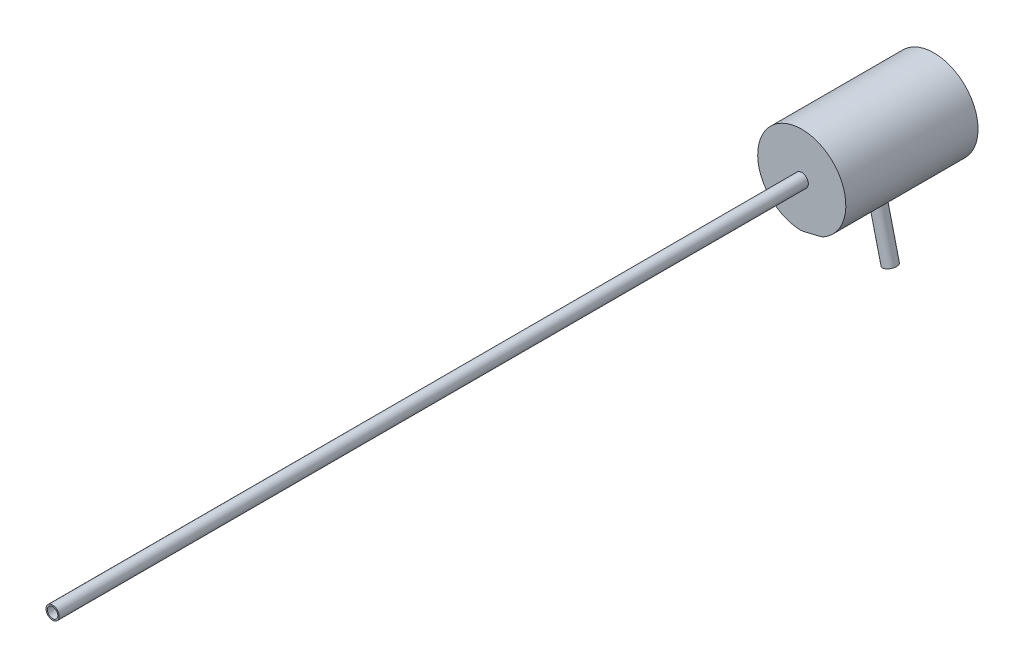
from build123d import *

# Parameters (mm, degrees)
SKETCH1_R          = 12.7
EXTRUDE1_DEPTH     = 38.1
SKETCH2_R          = 1.905
SKETCH2_R_2        = 1.503746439
EXTRUDE2_DEPTH     = 215.9
CUT_EXTRUDE1_DEPTH = 101.6
SKETCH4_R          = 1.905
SKETCH4_R_2        = 1.535957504
EXTRUDE3_DEPTH     = 15.71625
FILLET2_R          = 5.08


with BuildPart() as part:
    # Sketch1 → Extrude1 (new body)
    with BuildSketch(Plane.XY):
        with Locations(Location((0, 0, 0), (0, 0, 180))):
            Circle(SKETCH1_R)
    extrude(amount=EXTRUDE1_DEPTH)

    # Sketch2 → Extrude2 (add)
    with BuildSketch(Plane.XY.offset(38.1)):
        Circle(SKETCH2_R)
        Circle(SKETCH2_R_2, mode=Mode.SUBTRACT)
    extrude(amount=EXTRUDE2_DEPTH)

    # Sketch3 → Cut-Extrude1 (cut)
    with BuildSketch(Plane(origin=(0, 0, 0), x_dir=(-1, 0, 0), z_dir=(0, 0, -1))):
        Polygon((0, -12.7), (-5.800337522, -11.298056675), (-3.39189598, -15.241830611), align=None)
    extrude(amount=-CUT_EXTRUDE1_DEPTH, mode=Mode.SUBTRACT)

    # Sketch4 → Extrude3 (add)
    with BuildSketch(Plane(origin=(2.900168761, -11.999028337, 0), x_dir=(0.9720109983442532, 0.23493535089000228, 0), z_dir=(0.23493535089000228, -0.9720109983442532, 0))):
        with Locations(Location((0, 19.183526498, 0), (0, 0, 180))):
            Circle(SKETCH4_R)
        with Locations((0, 19.183526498)):
            Circle(SKETCH4_R_2, mode=Mode.SUBTRACT)
    extrude(amount=EXTRUDE3_DEPTH)

    # Fillet2
    fillet2_edges = [part.edges().sort_by_distance(p)[0] for p in [
        (0, -12.7, 19.05),
        (5.800337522, -11.298056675, 19.05),
    ]]
    fillet(fillet2_edges, radius=FILLET2_R)


solid = part.part
